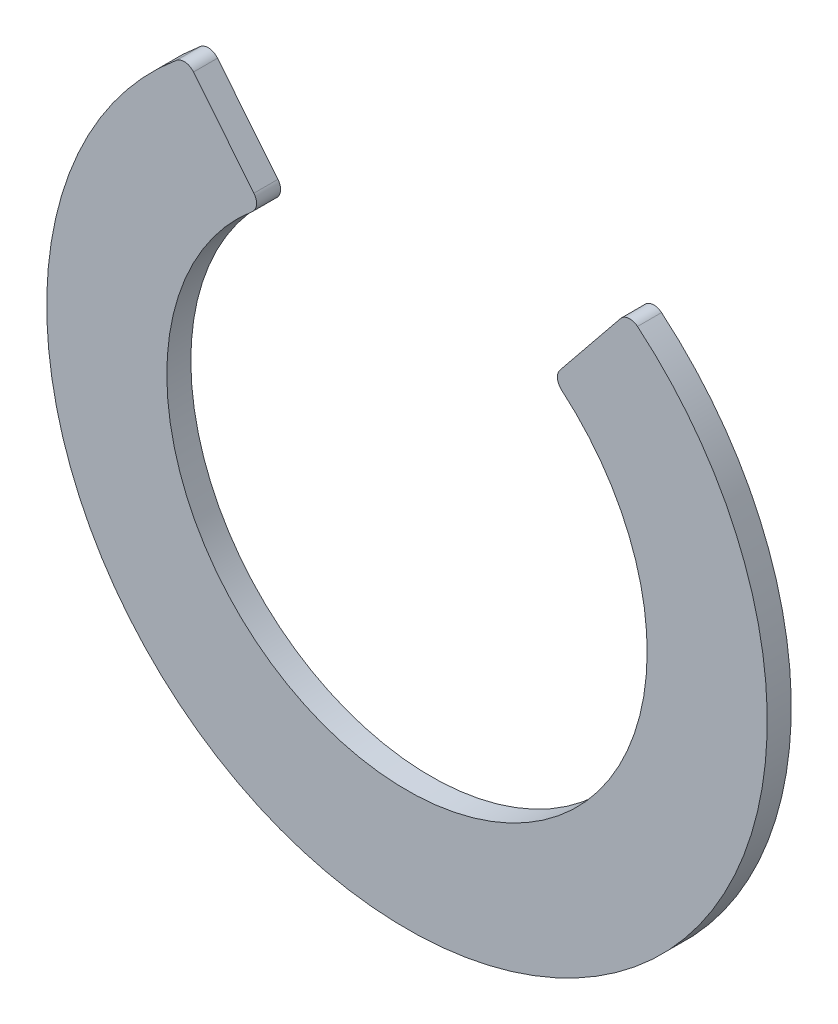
from build123d import *

# Parameters (mm, degrees)
BOSS_EXTRUDE1_DEPTH = 0.2


with BuildPart() as part:
    # Sketch1 → Boss-Extrude1 (new body)
    with BuildSketch(Plane.XY):
        with BuildLine():
            Line((-1.777852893, 2.291481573), (-1.274792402, 1.669297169))
            ThreePointArc((-1.274792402, 1.669297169), (-1.253010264, 1.596885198), (-1.28814697, 1.529927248))
            ThreePointArc((-1.28814697, 1.529927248), (0, -2), (1.28814697, 1.529927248))
            ThreePointArc((1.28814697, 1.529927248), (1.253010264, 1.596885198), (1.274792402, 1.669297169))
            Line((1.274792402, 1.669297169), (1.777852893, 2.291481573))
            ThreePointArc((1.777852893, 2.291481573), (1.84580338, 2.328125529), (1.919601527, 2.305456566))
            ThreePointArc((1.919601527, 2.305456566), (0, -3), (-1.919601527, 2.305456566))
            ThreePointArc((-1.919601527, 2.305456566), (-1.84580338, 2.328125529), (-1.777852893, 2.291481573))
        make_face()
    extrude(amount=BOSS_EXTRUDE1_DEPTH)


solid = part.part
